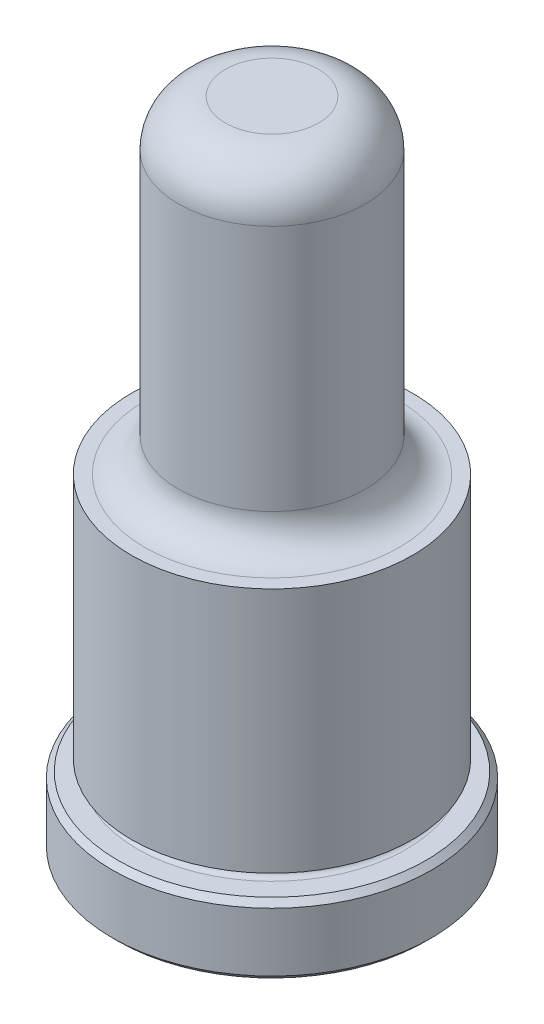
ISO-10303-21;
HEADER;
FILE_DESCRIPTION(('STEP AP214'),'2;1');
FILE_NAME('part.step','',(''),(''),'','','');
FILE_SCHEMA(('AUTOMOTIVE_DESIGN { 1 0 10303 214 1 1 1 1 }'));
ENDSEC;
DATA;
#1=APPLICATION_CONTEXT('core data for automotive mechanical design processes');
#2=APPLICATION_PROTOCOL_DEFINITION('international standard','automotive_design',2000,#1);
#3=PRODUCT_CONTEXT('',#1,'mechanical');
#4=PRODUCT('Part','Part','',(#3));
#5=PRODUCT_RELATED_PRODUCT_CATEGORY('part','',(#4));
#6=PRODUCT_DEFINITION_FORMATION('','',#4);
#7=PRODUCT_DEFINITION_CONTEXT('part definition',#1,'design');
#8=PRODUCT_DEFINITION('design','',#6,#7);
#9=PRODUCT_DEFINITION_SHAPE('','',#8);
#10=(LENGTH_UNIT() NAMED_UNIT(*) SI_UNIT(.MILLI.,.METRE.));
#11=(NAMED_UNIT(*) PLANE_ANGLE_UNIT() SI_UNIT($,.RADIAN.));
#12=(NAMED_UNIT(*) SI_UNIT($,.STERADIAN.) SOLID_ANGLE_UNIT());
#13=UNCERTAINTY_MEASURE_WITH_UNIT(LENGTH_MEASURE(1.E-05),#10,'distance_accuracy_value','');
#14=(GEOMETRIC_REPRESENTATION_CONTEXT(3) GLOBAL_UNCERTAINTY_ASSIGNED_CONTEXT((#13)) GLOBAL_UNIT_ASSIGNED_CONTEXT((#10,
#11,#12)) REPRESENTATION_CONTEXT('',''));
#15=CARTESIAN_POINT('',(0.,0.,0.));
#16=DIRECTION('',(0.,0.,1.));
#17=DIRECTION('',(1.,0.,0.));
#18=AXIS2_PLACEMENT_3D('',#15,#16,#17);
#19=CARTESIAN_POINT('',(0.,0.,0.));
#20=DIRECTION('',(0.,1.,0.));
#21=DIRECTION('',(0.,0.,1.));
#22=AXIS2_PLACEMENT_3D('',#19,#20,#21);
#23=PLANE('',#22);
#24=CARTESIAN_POINT('',(0.,0.,0.));
#25=DIRECTION('',(0.,1.,0.));
#26=DIRECTION('',(0.,0.,1.));
#27=AXIS2_PLACEMENT_3D('',#24,#25,#26);
#28=CIRCLE('',#27,10.4521);
#29=CARTESIAN_POINT('',(0.,0.,10.4521));
#30=VERTEX_POINT('',#29);
#31=EDGE_CURVE('E38',#30,#30,#28,.F.);
#32=ORIENTED_EDGE('',*,*,#31,.T.);
#33=EDGE_LOOP('',(#32));
#34=FACE_BOUND('',#33,.T.);
#35=ADVANCED_FACE('F31',(#34),#23,.F.);
#36=CARTESIAN_POINT('',(0.,0.,0.));
#37=DIRECTION('',(0.,1.,0.));
#38=DIRECTION('',(0.,0.,1.));
#39=AXIS2_PLACEMENT_3D('',#36,#37,#38);
#40=CYLINDRICAL_SURFACE('',#39,10.8331);
#41=CARTESIAN_POINT('',(0.,0.380999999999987,0.));
#42=DIRECTION('',(0.,1.,0.));
#43=DIRECTION('',(0.,0.,1.));
#44=AXIS2_PLACEMENT_3D('',#41,#42,#43);
#45=CIRCLE('',#44,10.8331);
#46=CARTESIAN_POINT('',(0.,0.380999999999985,10.8331));
#47=VERTEX_POINT('',#46);
#48=EDGE_CURVE('E42',#47,#47,#45,.T.);
#49=ORIENTED_EDGE('',*,*,#48,.T.);
#50=EDGE_LOOP('',(#49));
#51=FACE_BOUND('',#50,.T.);
#52=CARTESIAN_POINT('',(0.,4.3688,0.));
#53=DIRECTION('',(0.,-1.,0.));
#54=DIRECTION('',(0.,0.,-1.));
#55=AXIS2_PLACEMENT_3D('',#52,#53,#54);
#56=CIRCLE('',#55,10.8331);
#57=CARTESIAN_POINT('',(0.,4.3688,-10.8331));
#58=VERTEX_POINT('',#57);
#59=EDGE_CURVE('E46',#58,#58,#56,.T.);
#60=ORIENTED_EDGE('',*,*,#59,.T.);
#61=EDGE_LOOP('',(#60));
#62=FACE_BOUND('',#61,.T.);
#63=ADVANCED_FACE('F110',(#51,#62),#40,.T.);
#64=CARTESIAN_POINT('',(0.,4.7498,-10.8331));
#65=DIRECTION('',(0.,-1.,0.));
#66=DIRECTION('',(0.,0.,-1.));
#67=AXIS2_PLACEMENT_3D('',#64,#65,#66);
#68=PLANE('',#67);
#69=CARTESIAN_POINT('',(0.,4.7498,0.));
#70=DIRECTION('',(0.,-1.,0.));
#71=DIRECTION('',(0.,0.,-1.));
#72=AXIS2_PLACEMENT_3D('',#69,#70,#71);
#73=CIRCLE('',#72,10.4521);
#74=CARTESIAN_POINT('',(0.,4.7498,-10.4521));
#75=VERTEX_POINT('',#74);
#76=EDGE_CURVE('E10',#75,#75,#73,.F.);
#77=ORIENTED_EDGE('',*,*,#76,.T.);
#78=EDGE_LOOP('',(#77));
#79=FACE_BOUND('',#78,.T.);
#80=CARTESIAN_POINT('',(0.,4.7498,0.));
#81=DIRECTION('',(0.,1.,0.));
#82=DIRECTION('',(0.,0.,1.));
#83=AXIS2_PLACEMENT_3D('',#80,#81,#82);
#84=CIRCLE('',#83,9.13129999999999);
#85=CARTESIAN_POINT('',(0.,4.7498,9.13129999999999));
#86=VERTEX_POINT('',#85);
#87=EDGE_CURVE('E57',#86,#86,#84,.T.);
#88=ORIENTED_EDGE('',*,*,#87,.F.);
#89=EDGE_LOOP('',(#88));
#90=FACE_BOUND('',#89,.T.);
#91=ADVANCED_FACE('F105',(#79,#90),#68,.F.);
#92=CARTESIAN_POINT('',(0.,5.1308,0.));
#93=DIRECTION('',(0.,1.,0.));
#94=DIRECTION('',(0.,0.,1.));
#95=AXIS2_PLACEMENT_3D('',#92,#93,#94);
#96=TOROIDAL_SURFACE('',#95,9.13129999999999,0.381);
#97=CARTESIAN_POINT('',(0.,5.5118,0.));
#98=DIRECTION('',(0.,1.,0.));
#99=DIRECTION('',(0.,0.,1.));
#100=AXIS2_PLACEMENT_3D('',#97,#98,#99);
#101=CIRCLE('',#100,9.13129999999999);
#102=CARTESIAN_POINT('',(0.,5.5118,9.13129999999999));
#103=VERTEX_POINT('',#102);
#104=EDGE_CURVE('E60',#103,#103,#101,.T.);
#105=ORIENTED_EDGE('',*,*,#104,.F.);
#106=EDGE_LOOP('',(#105));
#107=FACE_BOUND('',#106,.T.);
#108=ORIENTED_EDGE('',*,*,#87,.T.);
#109=EDGE_LOOP('',(#108));
#110=FACE_BOUND('',#109,.T.);
#111=ADVANCED_FACE('F99',(#107,#110),#96,.F.);
#112=CARTESIAN_POINT('',(0.,5.5118,-9.13129999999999));
#113=DIRECTION('',(0.,1.,0.));
#114=DIRECTION('',(0.,0.,1.));
#115=AXIS2_PLACEMENT_3D('',#112,#113,#114);
#116=PLANE('',#115);
#117=CARTESIAN_POINT('',(0.,5.5118,0.));
#118=DIRECTION('',(0.,1.,0.));
#119=DIRECTION('',(0.,0.,1.));
#120=AXIS2_PLACEMENT_3D('',#117,#118,#119);
#121=CIRCLE('',#120,9.53769999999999);
#122=CARTESIAN_POINT('',(0.,5.5118,9.53769999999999));
#123=VERTEX_POINT('',#122);
#124=EDGE_CURVE('E63',#123,#123,#121,.T.);
#125=ORIENTED_EDGE('',*,*,#124,.F.);
#126=EDGE_LOOP('',(#125));
#127=FACE_BOUND('',#126,.T.);
#128=ORIENTED_EDGE('',*,*,#104,.T.);
#129=EDGE_LOOP('',(#128));
#130=FACE_BOUND('',#129,.T.);
#131=ADVANCED_FACE('F93',(#127,#130),#116,.F.);
#132=CARTESIAN_POINT('',(0.,0.,0.));
#133=DIRECTION('',(0.,1.,0.));
#134=DIRECTION('',(0.,0.,1.));
#135=AXIS2_PLACEMENT_3D('',#132,#133,#134);
#136=CYLINDRICAL_SURFACE('',#135,9.5377);
#137=CARTESIAN_POINT('',(0.,22.225,0.));
#138=DIRECTION('',(0.,1.,0.));
#139=DIRECTION('',(0.,0.,1.));
#140=AXIS2_PLACEMENT_3D('',#137,#138,#139);
#141=CIRCLE('',#140,9.5377);
#142=CARTESIAN_POINT('',(0.,22.225,9.5377));
#143=VERTEX_POINT('',#142);
#144=EDGE_CURVE('E66',#143,#143,#141,.T.);
#145=ORIENTED_EDGE('',*,*,#144,.F.);
#146=EDGE_LOOP('',(#145));
#147=FACE_BOUND('',#146,.T.);
#148=ORIENTED_EDGE('',*,*,#124,.T.);
#149=EDGE_LOOP('',(#148));
#150=FACE_BOUND('',#149,.T.);
#151=ADVANCED_FACE('F87',(#147,#150),#136,.T.);
#152=CARTESIAN_POINT('',(0.,22.225,-9.53769999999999));
#153=DIRECTION('',(0.,-1.,0.));
#154=DIRECTION('',(0.,0.,-1.));
#155=AXIS2_PLACEMENT_3D('',#152,#153,#154);
#156=PLANE('',#155);
#157=CARTESIAN_POINT('',(0.,22.225,0.));
#158=DIRECTION('',(0.,1.,0.));
#159=DIRECTION('',(0.,0.,1.));
#160=AXIS2_PLACEMENT_3D('',#157,#158,#159);
#161=CIRCLE('',#160,8.62329999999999);
#162=CARTESIAN_POINT('',(0.,22.225,8.6233));
#163=VERTEX_POINT('',#162);
#164=EDGE_CURVE('E69',#163,#163,#161,.T.);
#165=ORIENTED_EDGE('',*,*,#164,.F.);
#166=EDGE_LOOP('',(#165));
#167=FACE_BOUND('',#166,.T.);
#168=ORIENTED_EDGE('',*,*,#144,.T.);
#169=EDGE_LOOP('',(#168));
#170=FACE_BOUND('',#169,.T.);
#171=ADVANCED_FACE('F81',(#167,#170),#156,.F.);
#172=CARTESIAN_POINT('',(0.,24.511,0.));
#173=DIRECTION('',(0.,1.,0.));
#174=DIRECTION('',(0.,0.,1.));
#175=AXIS2_PLACEMENT_3D('',#172,#173,#174);
#176=TOROIDAL_SURFACE('',#175,8.6233,2.286);
#177=CARTESIAN_POINT('',(0.,24.511,0.));
#178=DIRECTION('',(0.,1.,0.));
#179=DIRECTION('',(0.,0.,1.));
#180=AXIS2_PLACEMENT_3D('',#177,#178,#179);
#181=CIRCLE('',#180,6.33729999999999);
#182=CARTESIAN_POINT('',(0.,24.511,6.3373));
#183=VERTEX_POINT('',#182);
#184=EDGE_CURVE('E72',#183,#183,#181,.T.);
#185=ORIENTED_EDGE('',*,*,#184,.F.);
#186=EDGE_LOOP('',(#185));
#187=FACE_BOUND('',#186,.T.);
#188=ORIENTED_EDGE('',*,*,#164,.T.);
#189=EDGE_LOOP('',(#188));
#190=FACE_BOUND('',#189,.T.);
#191=ADVANCED_FACE('F78',(#187,#190),#176,.F.);
#192=CARTESIAN_POINT('',(0.,0.,0.));
#193=DIRECTION('',(0.,1.,0.));
#194=DIRECTION('',(0.,0.,1.));
#195=AXIS2_PLACEMENT_3D('',#192,#193,#194);
#196=CYLINDRICAL_SURFACE('',#195,6.3373);
#197=CARTESIAN_POINT('',(0.,41.275,0.));
#198=DIRECTION('',(0.,-1.,0.));
#199=DIRECTION('',(0.,0.,-1.));
#200=AXIS2_PLACEMENT_3D('',#197,#198,#199);
#201=CIRCLE('',#200,6.3373);
#202=CARTESIAN_POINT('',(0.,41.275,-6.33729999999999));
#203=VERTEX_POINT('',#202);
#204=EDGE_CURVE('E51',#203,#203,#201,.T.);
#205=ORIENTED_EDGE('',*,*,#204,.T.);
#206=EDGE_LOOP('',(#205));
#207=FACE_BOUND('',#206,.T.);
#208=ORIENTED_EDGE('',*,*,#184,.T.);
#209=EDGE_LOOP('',(#208));
#210=FACE_BOUND('',#209,.T.);
#211=ADVANCED_FACE('F76',(#207,#210),#196,.T.);
#212=CARTESIAN_POINT('',(0.,44.45,-6.33729999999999));
#213=DIRECTION('',(0.,-1.,0.));
#214=DIRECTION('',(0.,0.,-1.));
#215=AXIS2_PLACEMENT_3D('',#212,#213,#214);
#216=PLANE('',#215);
#217=CARTESIAN_POINT('',(0.,44.45,0.));
#218=DIRECTION('',(0.,-1.,0.));
#219=DIRECTION('',(0.,0.,-1.));
#220=AXIS2_PLACEMENT_3D('',#217,#218,#219);
#221=CIRCLE('',#220,3.1623);
#222=CARTESIAN_POINT('',(0.,44.45,-3.16229999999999));
#223=VERTEX_POINT('',#222);
#224=EDGE_CURVE('E54',#223,#223,#221,.F.);
#225=ORIENTED_EDGE('',*,*,#224,.T.);
#226=EDGE_LOOP('',(#225));
#227=FACE_BOUND('',#226,.T.);
#228=ADVANCED_FACE('F125',(#227),#216,.F.);
#229=CARTESIAN_POINT('',(0.,41.275,0.));
#230=DIRECTION('',(0.,-1.,0.));
#231=DIRECTION('',(0.,0.,-1.));
#232=AXIS2_PLACEMENT_3D('',#229,#230,#231);
#233=DEGENERATE_TOROIDAL_SURFACE('',#232,3.1623,3.175,.T.);
#234=ORIENTED_EDGE('',*,*,#204,.F.);
#235=EDGE_LOOP('',(#234));
#236=FACE_BOUND('',#235,.T.);
#237=ORIENTED_EDGE('',*,*,#224,.F.);
#238=EDGE_LOOP('',(#237));
#239=FACE_BOUND('',#238,.T.);
#240=ADVANCED_FACE('F122',(#236,#239),#233,.T.);
#241=CARTESIAN_POINT('',(0.,0.380999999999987,0.));
#242=DIRECTION('',(0.,1.,0.));
#243=DIRECTION('',(0.,0.,1.));
#244=AXIS2_PLACEMENT_3D('',#241,#242,#243);
#245=CONICAL_SURFACE('',#244,10.8331,0.785398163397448);
#246=ORIENTED_EDGE('',*,*,#31,.F.);
#247=EDGE_LOOP('',(#246));
#248=FACE_BOUND('',#247,.T.);
#249=ORIENTED_EDGE('',*,*,#48,.F.);
#250=EDGE_LOOP('',(#249));
#251=FACE_BOUND('',#250,.T.);
#252=ADVANCED_FACE('F124',(#248,#251),#245,.T.);
#253=CARTESIAN_POINT('',(0.,4.7498,0.));
#254=DIRECTION('',(0.,-1.,0.));
#255=DIRECTION('',(0.,0.,-1.));
#256=AXIS2_PLACEMENT_3D('',#253,#254,#255);
#257=CONICAL_SURFACE('',#256,10.4521,0.785398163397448);
#258=ORIENTED_EDGE('',*,*,#59,.F.);
#259=EDGE_LOOP('',(#258));
#260=FACE_BOUND('',#259,.T.);
#261=ORIENTED_EDGE('',*,*,#76,.F.);
#262=EDGE_LOOP('',(#261));
#263=FACE_BOUND('',#262,.T.);
#264=ADVANCED_FACE('F33',(#260,#263),#257,.T.);
#265=CLOSED_SHELL('',(#35,#63,#91,#111,#131,#151,#171,#191,#211,#228,#240,#252,#264));
#266=MANIFOLD_SOLID_BREP('B2',#265);
#267=ADVANCED_BREP_SHAPE_REPRESENTATION('',(#18,#266),#14);
#268=SHAPE_DEFINITION_REPRESENTATION(#9,#267);
ENDSEC;
END-ISO-10303-21;
